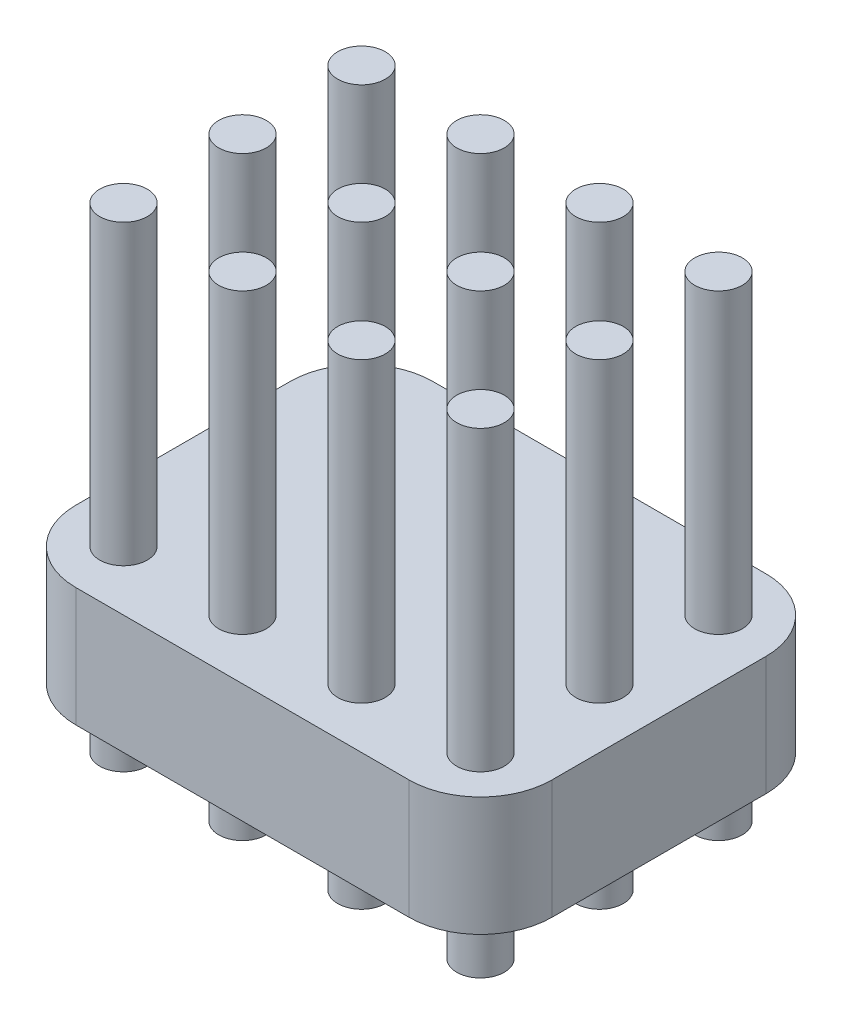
ISO-10303-21;
HEADER;
FILE_DESCRIPTION(('STEP AP214'),'2;1');
FILE_NAME('part.step','',(''),(''),'','','');
FILE_SCHEMA(('AUTOMOTIVE_DESIGN { 1 0 10303 214 1 1 1 1 }'));
ENDSEC;
DATA;
#1=APPLICATION_CONTEXT('core data for automotive mechanical design processes');
#2=APPLICATION_PROTOCOL_DEFINITION('international standard','automotive_design',2000,#1);
#3=PRODUCT_CONTEXT('',#1,'mechanical');
#4=PRODUCT('Part','Part','',(#3));
#5=PRODUCT_RELATED_PRODUCT_CATEGORY('part','',(#4));
#6=PRODUCT_DEFINITION_FORMATION('','',#4);
#7=PRODUCT_DEFINITION_CONTEXT('part definition',#1,'design');
#8=PRODUCT_DEFINITION('design','',#6,#7);
#9=PRODUCT_DEFINITION_SHAPE('','',#8);
#10=(LENGTH_UNIT() NAMED_UNIT(*) SI_UNIT(.MILLI.,.METRE.));
#11=(NAMED_UNIT(*) PLANE_ANGLE_UNIT() SI_UNIT($,.RADIAN.));
#12=(NAMED_UNIT(*) SI_UNIT($,.STERADIAN.) SOLID_ANGLE_UNIT());
#13=UNCERTAINTY_MEASURE_WITH_UNIT(LENGTH_MEASURE(1.E-05),#10,'distance_accuracy_value','');
#14=(GEOMETRIC_REPRESENTATION_CONTEXT(3) GLOBAL_UNCERTAINTY_ASSIGNED_CONTEXT((#13)) GLOBAL_UNIT_ASSIGNED_CONTEXT((#10,
#11,#12)) REPRESENTATION_CONTEXT('',''));
#15=CARTESIAN_POINT('',(0.,0.,0.));
#16=DIRECTION('',(0.,0.,1.));
#17=DIRECTION('',(1.,0.,0.));
#18=AXIS2_PLACEMENT_3D('',#15,#16,#17);
#19=CARTESIAN_POINT('',(-7.5,-5.,-4.99999999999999));
#20=DIRECTION('',(0.,1.,0.));
#21=DIRECTION('',(0.,0.,1.));
#22=AXIS2_PLACEMENT_3D('',#19,#20,#21);
#23=CYLINDRICAL_SURFACE('',#22,1.);
#24=CARTESIAN_POINT('',(-7.5,-5.,-4.99999999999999));
#25=DIRECTION('',(0.,1.,0.));
#26=DIRECTION('',(0.,0.,1.));
#27=AXIS2_PLACEMENT_3D('',#24,#25,#26);
#28=CIRCLE('',#27,1.);
#29=CARTESIAN_POINT('',(-7.5,-5.,-3.99999999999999));
#30=VERTEX_POINT('',#29);
#31=EDGE_CURVE('E11',#30,#30,#28,.T.);
#32=ORIENTED_EDGE('',*,*,#31,.T.);
#33=EDGE_LOOP('',(#32));
#34=FACE_BOUND('',#33,.T.);
#35=CARTESIAN_POINT('',(-7.5,15.,-4.99999999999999));
#36=DIRECTION('',(0.,1.,0.));
#37=DIRECTION('',(0.,0.,1.));
#38=AXIS2_PLACEMENT_3D('',#35,#36,#37);
#39=CIRCLE('',#38,1.);
#40=CARTESIAN_POINT('',(-7.5,15.,-3.99999999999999));
#41=VERTEX_POINT('',#40);
#42=EDGE_CURVE('E51',#41,#41,#39,.T.);
#43=ORIENTED_EDGE('',*,*,#42,.F.);
#44=EDGE_LOOP('',(#43));
#45=FACE_BOUND('',#44,.T.);
#46=ADVANCED_FACE('F45',(#34,#45),#23,.T.);
#47=CARTESIAN_POINT('',(-7.5,-5.,-4.99999999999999));
#48=DIRECTION('',(0.,1.,0.));
#49=DIRECTION('',(0.,0.,1.));
#50=AXIS2_PLACEMENT_3D('',#47,#48,#49);
#51=PLANE('',#50);
#52=ORIENTED_EDGE('',*,*,#31,.F.);
#53=EDGE_LOOP('',(#52));
#54=FACE_BOUND('',#53,.T.);
#55=ADVANCED_FACE('F60',(#54),#51,.F.);
#56=CARTESIAN_POINT('',(-7.5,15.,-4.99999999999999));
#57=DIRECTION('',(0.,1.,0.));
#58=DIRECTION('',(0.,0.,1.));
#59=AXIS2_PLACEMENT_3D('',#56,#57,#58);
#60=PLANE('',#59);
#61=ORIENTED_EDGE('',*,*,#42,.T.);
#62=EDGE_LOOP('',(#61));
#63=FACE_BOUND('',#62,.T.);
#64=ADVANCED_FACE('F57',(#63),#60,.T.);
#65=CLOSED_SHELL('',(#46,#55,#64));
#66=MANIFOLD_SOLID_BREP('B2',#65);
#67=CARTESIAN_POINT('',(-10.,2.5,-7.49999999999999));
#68=DIRECTION('',(1.,0.,0.));
#69=DIRECTION('',(0.,0.,-1.));
#70=AXIS2_PLACEMENT_3D('',#67,#68,#69);
#71=PLANE('',#70);
#72=DIRECTION('',(0.,0.,1.));
#73=VECTOR('',#72,1.);
#74=CARTESIAN_POINT('',(-10.,-2.5,-7.49999999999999));
#75=LINE('',#74,#73);
#76=CARTESIAN_POINT('',(-10.,-2.5,-4.49999999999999));
#77=VERTEX_POINT('',#76);
#78=CARTESIAN_POINT('',(-10.,-2.5,4.50000000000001));
#79=VERTEX_POINT('',#78);
#80=EDGE_CURVE('E182',#77,#79,#75,.T.);
#81=ORIENTED_EDGE('',*,*,#80,.T.);
#82=DIRECTION('',(0.,-1.,0.));
#83=VECTOR('',#82,1.);
#84=CARTESIAN_POINT('',(-10.,2.5,4.50000000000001));
#85=LINE('',#84,#83);
#86=CARTESIAN_POINT('',(-10.,2.5,4.50000000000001));
#87=VERTEX_POINT('',#86);
#88=EDGE_CURVE('E43',#79,#87,#85,.F.);
#89=ORIENTED_EDGE('',*,*,#88,.T.);
#90=DIRECTION('',(0.,0.,1.));
#91=VECTOR('',#90,1.);
#92=CARTESIAN_POINT('',(-10.,2.5,-7.49999999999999));
#93=LINE('',#92,#91);
#94=CARTESIAN_POINT('',(-10.,2.5,-4.49999999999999));
#95=VERTEX_POINT('',#94);
#96=EDGE_CURVE('E180',#95,#87,#93,.T.);
#97=ORIENTED_EDGE('',*,*,#96,.F.);
#98=DIRECTION('',(0.,-1.,0.));
#99=VECTOR('',#98,1.);
#100=CARTESIAN_POINT('',(-10.,2.5,-4.49999999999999));
#101=LINE('',#100,#99);
#102=EDGE_CURVE('E94',#95,#77,#101,.T.);
#103=ORIENTED_EDGE('',*,*,#102,.T.);
#104=EDGE_LOOP('',(#81,#89,#97,#103));
#105=FACE_BOUND('',#104,.T.);
#106=ADVANCED_FACE('F86',(#105),#71,.F.);
#107=CARTESIAN_POINT('',(10.,2.5,7.50000000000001));
#108=DIRECTION('',(0.,0.,-1.));
#109=DIRECTION('',(-1.,0.,0.));
#110=AXIS2_PLACEMENT_3D('',#107,#108,#109);
#111=PLANE('',#110);
#112=DIRECTION('',(1.,0.,0.));
#113=VECTOR('',#112,1.);
#114=CARTESIAN_POINT('',(10.,-2.5,7.50000000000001));
#115=LINE('',#114,#113);
#116=CARTESIAN_POINT('',(-7.,-2.5,7.50000000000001));
#117=VERTEX_POINT('',#116);
#118=CARTESIAN_POINT('',(7.,-2.5,7.50000000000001));
#119=VERTEX_POINT('',#118);
#120=EDGE_CURVE('E178',#117,#119,#115,.T.);
#121=ORIENTED_EDGE('',*,*,#120,.T.);
#122=DIRECTION('',(0.,-1.,0.));
#123=VECTOR('',#122,1.);
#124=CARTESIAN_POINT('',(7.,2.5,7.50000000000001));
#125=LINE('',#124,#123);
#126=CARTESIAN_POINT('',(7.,2.5,7.50000000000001));
#127=VERTEX_POINT('',#126);
#128=EDGE_CURVE('E157',#119,#127,#125,.F.);
#129=ORIENTED_EDGE('',*,*,#128,.T.);
#130=DIRECTION('',(1.,0.,0.));
#131=VECTOR('',#130,1.);
#132=CARTESIAN_POINT('',(10.,2.5,7.50000000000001));
#133=LINE('',#132,#131);
#134=CARTESIAN_POINT('',(-7.,2.5,7.50000000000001));
#135=VERTEX_POINT('',#134);
#136=EDGE_CURVE('E255',#135,#127,#133,.T.);
#137=ORIENTED_EDGE('',*,*,#136,.F.);
#138=DIRECTION('',(0.,-1.,0.));
#139=VECTOR('',#138,1.);
#140=CARTESIAN_POINT('',(-7.,2.5,7.50000000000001));
#141=LINE('',#140,#139);
#142=EDGE_CURVE('E162',#135,#117,#141,.T.);
#143=ORIENTED_EDGE('',*,*,#142,.T.);
#144=EDGE_LOOP('',(#121,#129,#137,#143));
#145=FACE_BOUND('',#144,.T.);
#146=ADVANCED_FACE('F392',(#145),#111,.F.);
#147=CARTESIAN_POINT('',(10.,2.5,-7.49999999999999));
#148=DIRECTION('',(-1.,0.,0.));
#149=DIRECTION('',(0.,0.,1.));
#150=AXIS2_PLACEMENT_3D('',#147,#148,#149);
#151=PLANE('',#150);
#152=DIRECTION('',(0.,0.,-1.));
#153=VECTOR('',#152,1.);
#154=CARTESIAN_POINT('',(10.,2.5,-7.49999999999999));
#155=LINE('',#154,#153);
#156=CARTESIAN_POINT('',(10.,2.5,4.5));
#157=VERTEX_POINT('',#156);
#158=CARTESIAN_POINT('',(10.,2.5,-4.5));
#159=VERTEX_POINT('',#158);
#160=EDGE_CURVE('E171',#157,#159,#155,.T.);
#161=ORIENTED_EDGE('',*,*,#160,.F.);
#162=DIRECTION('',(0.,-1.,0.));
#163=VECTOR('',#162,1.);
#164=CARTESIAN_POINT('',(10.,2.5,4.5));
#165=LINE('',#164,#163);
#166=CARTESIAN_POINT('',(10.,-2.5,4.5));
#167=VERTEX_POINT('',#166);
#168=EDGE_CURVE('E156',#157,#167,#165,.T.);
#169=ORIENTED_EDGE('',*,*,#168,.T.);
#170=DIRECTION('',(0.,0.,-1.));
#171=VECTOR('',#170,1.);
#172=CARTESIAN_POINT('',(10.,-2.5,-7.49999999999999));
#173=LINE('',#172,#171);
#174=CARTESIAN_POINT('',(10.,-2.5,-4.5));
#175=VERTEX_POINT('',#174);
#176=EDGE_CURVE('E169',#167,#175,#173,.T.);
#177=ORIENTED_EDGE('',*,*,#176,.T.);
#178=DIRECTION('',(0.,-1.,0.));
#179=VECTOR('',#178,1.);
#180=CARTESIAN_POINT('',(10.,2.5,-4.5));
#181=LINE('',#180,#179);
#182=EDGE_CURVE('E173',#175,#159,#181,.F.);
#183=ORIENTED_EDGE('',*,*,#182,.T.);
#184=EDGE_LOOP('',(#161,#169,#177,#183));
#185=FACE_BOUND('',#184,.T.);
#186=ADVANCED_FACE('F168',(#185),#151,.F.);
#187=CARTESIAN_POINT('',(10.,2.5,-7.49999999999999));
#188=DIRECTION('',(0.,0.,1.));
#189=DIRECTION('',(1.,0.,0.));
#190=AXIS2_PLACEMENT_3D('',#187,#188,#189);
#191=PLANE('',#190);
#192=DIRECTION('',(-1.,0.,0.));
#193=VECTOR('',#192,1.);
#194=CARTESIAN_POINT('',(10.,2.5,-7.49999999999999));
#195=LINE('',#194,#193);
#196=CARTESIAN_POINT('',(7.,2.5,-7.49999999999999));
#197=VERTEX_POINT('',#196);
#198=CARTESIAN_POINT('',(-7.,2.5,-7.49999999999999));
#199=VERTEX_POINT('',#198);
#200=EDGE_CURVE('E190',#197,#199,#195,.T.);
#201=ORIENTED_EDGE('',*,*,#200,.F.);
#202=DIRECTION('',(0.,-1.,0.));
#203=VECTOR('',#202,1.);
#204=CARTESIAN_POINT('',(7.,2.5,-7.49999999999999));
#205=LINE('',#204,#203);
#206=CARTESIAN_POINT('',(7.,-2.5,-7.49999999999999));
#207=VERTEX_POINT('',#206);
#208=EDGE_CURVE('E236',#197,#207,#205,.T.);
#209=ORIENTED_EDGE('',*,*,#208,.T.);
#210=DIRECTION('',(-1.,0.,0.));
#211=VECTOR('',#210,1.);
#212=CARTESIAN_POINT('',(10.,-2.5,-7.49999999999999));
#213=LINE('',#212,#211);
#214=CARTESIAN_POINT('',(-7.,-2.5,-7.49999999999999));
#215=VERTEX_POINT('',#214);
#216=EDGE_CURVE('E177',#207,#215,#213,.T.);
#217=ORIENTED_EDGE('',*,*,#216,.T.);
#218=DIRECTION('',(0.,-1.,0.));
#219=VECTOR('',#218,1.);
#220=CARTESIAN_POINT('',(-7.,2.5,-7.49999999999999));
#221=LINE('',#220,#219);
#222=EDGE_CURVE('E101',#215,#199,#221,.F.);
#223=ORIENTED_EDGE('',*,*,#222,.T.);
#224=EDGE_LOOP('',(#201,#209,#217,#223));
#225=FACE_BOUND('',#224,.T.);
#226=ADVANCED_FACE('F367',(#225),#191,.F.);
#227=CARTESIAN_POINT('',(-10.,2.5,7.50000000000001));
#228=DIRECTION('',(0.,-1.,0.));
#229=DIRECTION('',(0.,0.,-1.));
#230=AXIS2_PLACEMENT_3D('',#227,#228,#229);
#231=PLANE('',#230);
#232=CARTESIAN_POINT('',(7.5,2.5,5.));
#233=DIRECTION('',(0.,-1.,0.));
#234=DIRECTION('',(0.,0.,-1.));
#235=AXIS2_PLACEMENT_3D('',#232,#233,#234);
#236=CIRCLE('',#235,1.);
#237=CARTESIAN_POINT('',(7.5,2.5,4.));
#238=VERTEX_POINT('',#237);
#239=EDGE_CURVE('E345',#238,#238,#236,.T.);
#240=ORIENTED_EDGE('',*,*,#239,.T.);
#241=EDGE_LOOP('',(#240));
#242=FACE_BOUND('',#241,.T.);
#243=CARTESIAN_POINT('',(7.5,2.5,0.));
#244=DIRECTION('',(0.,-1.,0.));
#245=DIRECTION('',(0.,0.,-1.));
#246=AXIS2_PLACEMENT_3D('',#243,#244,#245);
#247=CIRCLE('',#246,1.);
#248=CARTESIAN_POINT('',(7.5,2.5,-0.999999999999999));
#249=VERTEX_POINT('',#248);
#250=EDGE_CURVE('E336',#249,#249,#247,.T.);
#251=ORIENTED_EDGE('',*,*,#250,.T.);
#252=EDGE_LOOP('',(#251));
#253=FACE_BOUND('',#252,.T.);
#254=CARTESIAN_POINT('',(7.5,2.5,-5.));
#255=DIRECTION('',(0.,-1.,0.));
#256=DIRECTION('',(0.,0.,-1.));
#257=AXIS2_PLACEMENT_3D('',#254,#255,#256);
#258=CIRCLE('',#257,1.);
#259=CARTESIAN_POINT('',(7.5,2.5,-6.));
#260=VERTEX_POINT('',#259);
#261=EDGE_CURVE('E327',#260,#260,#258,.T.);
#262=ORIENTED_EDGE('',*,*,#261,.T.);
#263=EDGE_LOOP('',(#262));
#264=FACE_BOUND('',#263,.T.);
#265=CARTESIAN_POINT('',(2.5,2.5,5.));
#266=DIRECTION('',(0.,-1.,0.));
#267=DIRECTION('',(0.,0.,-1.));
#268=AXIS2_PLACEMENT_3D('',#265,#266,#267);
#269=CIRCLE('',#268,1.);
#270=CARTESIAN_POINT('',(2.5,2.5,4.));
#271=VERTEX_POINT('',#270);
#272=EDGE_CURVE('E318',#271,#271,#269,.T.);
#273=ORIENTED_EDGE('',*,*,#272,.T.);
#274=EDGE_LOOP('',(#273));
#275=FACE_BOUND('',#274,.T.);
#276=CARTESIAN_POINT('',(2.5,2.5,0.));
#277=DIRECTION('',(0.,-1.,0.));
#278=DIRECTION('',(0.,0.,-1.));
#279=AXIS2_PLACEMENT_3D('',#276,#277,#278);
#280=CIRCLE('',#279,1.);
#281=CARTESIAN_POINT('',(2.5,2.5,-0.999999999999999));
#282=VERTEX_POINT('',#281);
#283=EDGE_CURVE('E309',#282,#282,#280,.T.);
#284=ORIENTED_EDGE('',*,*,#283,.T.);
#285=EDGE_LOOP('',(#284));
#286=FACE_BOUND('',#285,.T.);
#287=CARTESIAN_POINT('',(2.5,2.5,-5.));
#288=DIRECTION('',(0.,-1.,0.));
#289=DIRECTION('',(0.,0.,-1.));
#290=AXIS2_PLACEMENT_3D('',#287,#288,#289);
#291=CIRCLE('',#290,1.);
#292=CARTESIAN_POINT('',(2.5,2.5,-6.));
#293=VERTEX_POINT('',#292);
#294=EDGE_CURVE('E300',#293,#293,#291,.T.);
#295=ORIENTED_EDGE('',*,*,#294,.T.);
#296=EDGE_LOOP('',(#295));
#297=FACE_BOUND('',#296,.T.);
#298=CARTESIAN_POINT('',(-2.5,2.5,5.00000000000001));
#299=DIRECTION('',(0.,-1.,0.));
#300=DIRECTION('',(0.,0.,-1.));
#301=AXIS2_PLACEMENT_3D('',#298,#299,#300);
#302=CIRCLE('',#301,1.);
#303=CARTESIAN_POINT('',(-2.5,2.5,4.));
#304=VERTEX_POINT('',#303);
#305=EDGE_CURVE('E291',#304,#304,#302,.T.);
#306=ORIENTED_EDGE('',*,*,#305,.T.);
#307=EDGE_LOOP('',(#306));
#308=FACE_BOUND('',#307,.T.);
#309=CARTESIAN_POINT('',(-2.5,2.5,0.));
#310=DIRECTION('',(0.,-1.,0.));
#311=DIRECTION('',(0.,0.,-1.));
#312=AXIS2_PLACEMENT_3D('',#309,#310,#311);
#313=CIRCLE('',#312,1.);
#314=CARTESIAN_POINT('',(-2.5,2.5,-0.999999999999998));
#315=VERTEX_POINT('',#314);
#316=EDGE_CURVE('E282',#315,#315,#313,.T.);
#317=ORIENTED_EDGE('',*,*,#316,.T.);
#318=EDGE_LOOP('',(#317));
#319=FACE_BOUND('',#318,.T.);
#320=CARTESIAN_POINT('',(-2.5,2.5,-4.99999999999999));
#321=DIRECTION('',(0.,-1.,0.));
#322=DIRECTION('',(0.,0.,-1.));
#323=AXIS2_PLACEMENT_3D('',#320,#321,#322);
#324=CIRCLE('',#323,1.);
#325=CARTESIAN_POINT('',(-2.5,2.5,-6.));
#326=VERTEX_POINT('',#325);
#327=EDGE_CURVE('E273',#326,#326,#324,.T.);
#328=ORIENTED_EDGE('',*,*,#327,.T.);
#329=EDGE_LOOP('',(#328));
#330=FACE_BOUND('',#329,.T.);
#331=CARTESIAN_POINT('',(-7.5,2.5,5.00000000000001));
#332=DIRECTION('',(0.,-1.,0.));
#333=DIRECTION('',(0.,0.,-1.));
#334=AXIS2_PLACEMENT_3D('',#331,#332,#333);
#335=CIRCLE('',#334,1.);
#336=CARTESIAN_POINT('',(-7.5,2.5,4.));
#337=VERTEX_POINT('',#336);
#338=EDGE_CURVE('E264',#337,#337,#335,.T.);
#339=ORIENTED_EDGE('',*,*,#338,.T.);
#340=EDGE_LOOP('',(#339));
#341=FACE_BOUND('',#340,.T.);
#342=CARTESIAN_POINT('',(-7.5,2.5,0.));
#343=DIRECTION('',(0.,-1.,0.));
#344=DIRECTION('',(0.,0.,-1.));
#345=AXIS2_PLACEMENT_3D('',#342,#343,#344);
#346=CIRCLE('',#345,1.);
#347=CARTESIAN_POINT('',(-7.5,2.5,-0.999999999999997));
#348=VERTEX_POINT('',#347);
#349=EDGE_CURVE('E248',#348,#348,#346,.T.);
#350=ORIENTED_EDGE('',*,*,#349,.T.);
#351=EDGE_LOOP('',(#350));
#352=FACE_BOUND('',#351,.T.);
#353=ORIENTED_EDGE('',*,*,#136,.T.);
#354=CARTESIAN_POINT('',(7.,2.5,4.5));
#355=DIRECTION('',(0.,-1.,0.));
#356=DIRECTION('',(0.,0.,-1.));
#357=AXIS2_PLACEMENT_3D('',#354,#355,#356);
#358=CIRCLE('',#357,3.);
#359=EDGE_CURVE('E233',#127,#157,#358,.F.);
#360=ORIENTED_EDGE('',*,*,#359,.T.);
#361=ORIENTED_EDGE('',*,*,#160,.T.);
#362=CARTESIAN_POINT('',(7.,2.5,-4.49999999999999));
#363=DIRECTION('',(0.,-1.,0.));
#364=DIRECTION('',(0.,0.,-1.));
#365=AXIS2_PLACEMENT_3D('',#362,#363,#364);
#366=CIRCLE('',#365,3.);
#367=EDGE_CURVE('E108',#159,#197,#366,.F.);
#368=ORIENTED_EDGE('',*,*,#367,.T.);
#369=ORIENTED_EDGE('',*,*,#200,.T.);
#370=CARTESIAN_POINT('',(-7.,2.5,-4.49999999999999));
#371=DIRECTION('',(0.,-1.,0.));
#372=DIRECTION('',(0.,0.,-1.));
#373=AXIS2_PLACEMENT_3D('',#370,#371,#372);
#374=CIRCLE('',#373,3.);
#375=EDGE_CURVE('E228',#199,#95,#374,.F.);
#376=ORIENTED_EDGE('',*,*,#375,.T.);
#377=ORIENTED_EDGE('',*,*,#96,.T.);
#378=CARTESIAN_POINT('',(-7.,2.5,4.50000000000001));
#379=DIRECTION('',(0.,-1.,0.));
#380=DIRECTION('',(0.,0.,-1.));
#381=AXIS2_PLACEMENT_3D('',#378,#379,#380);
#382=CIRCLE('',#381,3.);
#383=EDGE_CURVE('E230',#87,#135,#382,.F.);
#384=ORIENTED_EDGE('',*,*,#383,.T.);
#385=EDGE_LOOP('',(#353,#360,#361,#368,#369,#376,#377,#384));
#386=FACE_BOUND('',#385,.T.);
#387=ADVANCED_FACE('F364',(#242,#253,#264,#275,#286,#297,#308,#319,#330,#341,#352,#386),#231,.F.);
#388=CARTESIAN_POINT('',(-10.,-2.5,7.50000000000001));
#389=DIRECTION('',(0.,-1.,0.));
#390=DIRECTION('',(0.,0.,-1.));
#391=AXIS2_PLACEMENT_3D('',#388,#389,#390);
#392=PLANE('',#391);
#393=CARTESIAN_POINT('',(7.5,-2.5,5.));
#394=DIRECTION('',(0.,-1.,0.));
#395=DIRECTION('',(0.,0.,-1.));
#396=AXIS2_PLACEMENT_3D('',#393,#394,#395);
#397=CIRCLE('',#396,1.);
#398=CARTESIAN_POINT('',(7.5,-2.5,4.));
#399=VERTEX_POINT('',#398);
#400=EDGE_CURVE('E217',#399,#399,#397,.T.);
#401=ORIENTED_EDGE('',*,*,#400,.F.);
#402=EDGE_LOOP('',(#401));
#403=FACE_BOUND('',#402,.T.);
#404=CARTESIAN_POINT('',(7.5,-2.5,0.));
#405=DIRECTION('',(0.,-1.,0.));
#406=DIRECTION('',(0.,0.,-1.));
#407=AXIS2_PLACEMENT_3D('',#404,#405,#406);
#408=CIRCLE('',#407,1.);
#409=CARTESIAN_POINT('',(7.5,-2.5,-0.999999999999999));
#410=VERTEX_POINT('',#409);
#411=EDGE_CURVE('E214',#410,#410,#408,.T.);
#412=ORIENTED_EDGE('',*,*,#411,.F.);
#413=EDGE_LOOP('',(#412));
#414=FACE_BOUND('',#413,.T.);
#415=CARTESIAN_POINT('',(7.5,-2.5,-5.));
#416=DIRECTION('',(0.,-1.,0.));
#417=DIRECTION('',(0.,0.,-1.));
#418=AXIS2_PLACEMENT_3D('',#415,#416,#417);
#419=CIRCLE('',#418,1.);
#420=CARTESIAN_POINT('',(7.5,-2.5,-6.));
#421=VERTEX_POINT('',#420);
#422=EDGE_CURVE('E211',#421,#421,#419,.T.);
#423=ORIENTED_EDGE('',*,*,#422,.F.);
#424=EDGE_LOOP('',(#423));
#425=FACE_BOUND('',#424,.T.);
#426=CARTESIAN_POINT('',(2.5,-2.5,5.));
#427=DIRECTION('',(0.,-1.,0.));
#428=DIRECTION('',(0.,0.,-1.));
#429=AXIS2_PLACEMENT_3D('',#426,#427,#428);
#430=CIRCLE('',#429,1.);
#431=CARTESIAN_POINT('',(2.5,-2.5,4.));
#432=VERTEX_POINT('',#431);
#433=EDGE_CURVE('E208',#432,#432,#430,.T.);
#434=ORIENTED_EDGE('',*,*,#433,.F.);
#435=EDGE_LOOP('',(#434));
#436=FACE_BOUND('',#435,.T.);
#437=CARTESIAN_POINT('',(2.5,-2.5,0.));
#438=DIRECTION('',(0.,-1.,0.));
#439=DIRECTION('',(0.,0.,-1.));
#440=AXIS2_PLACEMENT_3D('',#437,#438,#439);
#441=CIRCLE('',#440,1.);
#442=CARTESIAN_POINT('',(2.5,-2.5,-0.999999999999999));
#443=VERTEX_POINT('',#442);
#444=EDGE_CURVE('E205',#443,#443,#441,.T.);
#445=ORIENTED_EDGE('',*,*,#444,.F.);
#446=EDGE_LOOP('',(#445));
#447=FACE_BOUND('',#446,.T.);
#448=CARTESIAN_POINT('',(2.5,-2.5,-5.));
#449=DIRECTION('',(0.,-1.,0.));
#450=DIRECTION('',(0.,0.,-1.));
#451=AXIS2_PLACEMENT_3D('',#448,#449,#450);
#452=CIRCLE('',#451,1.);
#453=CARTESIAN_POINT('',(2.5,-2.5,-6.));
#454=VERTEX_POINT('',#453);
#455=EDGE_CURVE('E202',#454,#454,#452,.T.);
#456=ORIENTED_EDGE('',*,*,#455,.F.);
#457=EDGE_LOOP('',(#456));
#458=FACE_BOUND('',#457,.T.);
#459=CARTESIAN_POINT('',(-2.5,-2.5,5.00000000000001));
#460=DIRECTION('',(0.,-1.,0.));
#461=DIRECTION('',(0.,0.,-1.));
#462=AXIS2_PLACEMENT_3D('',#459,#460,#461);
#463=CIRCLE('',#462,1.);
#464=CARTESIAN_POINT('',(-2.5,-2.5,4.));
#465=VERTEX_POINT('',#464);
#466=EDGE_CURVE('E199',#465,#465,#463,.T.);
#467=ORIENTED_EDGE('',*,*,#466,.F.);
#468=EDGE_LOOP('',(#467));
#469=FACE_BOUND('',#468,.T.);
#470=CARTESIAN_POINT('',(-2.5,-2.5,0.));
#471=DIRECTION('',(0.,-1.,0.));
#472=DIRECTION('',(0.,0.,-1.));
#473=AXIS2_PLACEMENT_3D('',#470,#471,#472);
#474=CIRCLE('',#473,1.);
#475=CARTESIAN_POINT('',(-2.5,-2.5,-0.999999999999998));
#476=VERTEX_POINT('',#475);
#477=EDGE_CURVE('E196',#476,#476,#474,.T.);
#478=ORIENTED_EDGE('',*,*,#477,.F.);
#479=EDGE_LOOP('',(#478));
#480=FACE_BOUND('',#479,.T.);
#481=CARTESIAN_POINT('',(-2.5,-2.5,-4.99999999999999));
#482=DIRECTION('',(0.,-1.,0.));
#483=DIRECTION('',(0.,0.,-1.));
#484=AXIS2_PLACEMENT_3D('',#481,#482,#483);
#485=CIRCLE('',#484,1.);
#486=CARTESIAN_POINT('',(-2.5,-2.5,-6.));
#487=VERTEX_POINT('',#486);
#488=EDGE_CURVE('E193',#487,#487,#485,.T.);
#489=ORIENTED_EDGE('',*,*,#488,.F.);
#490=EDGE_LOOP('',(#489));
#491=FACE_BOUND('',#490,.T.);
#492=CARTESIAN_POINT('',(-7.5,-2.5,5.00000000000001));
#493=DIRECTION('',(0.,-1.,0.));
#494=DIRECTION('',(0.,0.,-1.));
#495=AXIS2_PLACEMENT_3D('',#492,#493,#494);
#496=CIRCLE('',#495,1.);
#497=CARTESIAN_POINT('',(-7.5,-2.5,4.));
#498=VERTEX_POINT('',#497);
#499=EDGE_CURVE('E189',#498,#498,#496,.T.);
#500=ORIENTED_EDGE('',*,*,#499,.F.);
#501=EDGE_LOOP('',(#500));
#502=FACE_BOUND('',#501,.T.);
#503=CARTESIAN_POINT('',(-7.5,-2.5,0.));
#504=DIRECTION('',(0.,-1.,0.));
#505=DIRECTION('',(0.,0.,-1.));
#506=AXIS2_PLACEMENT_3D('',#503,#504,#505);
#507=CIRCLE('',#506,1.);
#508=CARTESIAN_POINT('',(-7.5,-2.5,-0.999999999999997));
#509=VERTEX_POINT('',#508);
#510=EDGE_CURVE('E186',#509,#509,#507,.T.);
#511=ORIENTED_EDGE('',*,*,#510,.F.);
#512=EDGE_LOOP('',(#511));
#513=FACE_BOUND('',#512,.T.);
#514=ORIENTED_EDGE('',*,*,#176,.F.);
#515=CARTESIAN_POINT('',(7.,-2.5,4.5));
#516=DIRECTION('',(0.,-1.,0.));
#517=DIRECTION('',(0.,0.,-1.));
#518=AXIS2_PLACEMENT_3D('',#515,#516,#517);
#519=CIRCLE('',#518,3.);
#520=EDGE_CURVE('E152',#167,#119,#519,.T.);
#521=ORIENTED_EDGE('',*,*,#520,.T.);
#522=ORIENTED_EDGE('',*,*,#120,.F.);
#523=CARTESIAN_POINT('',(-7.,-2.5,4.50000000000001));
#524=DIRECTION('',(0.,-1.,0.));
#525=DIRECTION('',(0.,0.,-1.));
#526=AXIS2_PLACEMENT_3D('',#523,#524,#525);
#527=CIRCLE('',#526,3.);
#528=EDGE_CURVE('E222',#117,#79,#527,.T.);
#529=ORIENTED_EDGE('',*,*,#528,.T.);
#530=ORIENTED_EDGE('',*,*,#80,.F.);
#531=CARTESIAN_POINT('',(-7.,-2.5,-4.49999999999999));
#532=DIRECTION('',(0.,-1.,0.));
#533=DIRECTION('',(0.,0.,-1.));
#534=AXIS2_PLACEMENT_3D('',#531,#532,#533);
#535=CIRCLE('',#534,3.);
#536=EDGE_CURVE('E172',#77,#215,#535,.T.);
#537=ORIENTED_EDGE('',*,*,#536,.T.);
#538=ORIENTED_EDGE('',*,*,#216,.F.);
#539=CARTESIAN_POINT('',(7.,-2.5,-4.49999999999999));
#540=DIRECTION('',(0.,-1.,0.));
#541=DIRECTION('',(0.,0.,-1.));
#542=AXIS2_PLACEMENT_3D('',#539,#540,#541);
#543=CIRCLE('',#542,3.);
#544=EDGE_CURVE('E163',#207,#175,#543,.T.);
#545=ORIENTED_EDGE('',*,*,#544,.T.);
#546=EDGE_LOOP('',(#514,#521,#522,#529,#530,#537,#538,#545));
#547=FACE_BOUND('',#546,.T.);
#548=ADVANCED_FACE('F175',(#403,#414,#425,#436,#447,#458,#469,#480,#491,#502,#513,#547),#392,.T.);
#549=CARTESIAN_POINT('',(-7.5,-5.,0.));
#550=DIRECTION('',(0.,1.,0.));
#551=DIRECTION('',(0.,0.,1.));
#552=AXIS2_PLACEMENT_3D('',#549,#550,#551);
#553=PLANE('',#552);
#554=CARTESIAN_POINT('',(-7.5,-5.,0.));
#555=DIRECTION('',(0.,1.,0.));
#556=DIRECTION('',(0.,0.,1.));
#557=AXIS2_PLACEMENT_3D('',#554,#555,#556);
#558=CIRCLE('',#557,1.);
#559=CARTESIAN_POINT('',(-7.5,-5.,1.00000000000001));
#560=VERTEX_POINT('',#559);
#561=EDGE_CURVE('E250',#560,#560,#558,.T.);
#562=ORIENTED_EDGE('',*,*,#561,.F.);
#563=EDGE_LOOP('',(#562));
#564=FACE_BOUND('',#563,.T.);
#565=ADVANCED_FACE('F422',(#564),#553,.F.);
#566=CARTESIAN_POINT('',(-7.5,-5.,0.));
#567=DIRECTION('',(0.,1.,0.));
#568=DIRECTION('',(0.,0.,1.));
#569=AXIS2_PLACEMENT_3D('',#566,#567,#568);
#570=CYLINDRICAL_SURFACE('',#569,1.);
#571=ORIENTED_EDGE('',*,*,#510,.T.);
#572=EDGE_LOOP('',(#571));
#573=FACE_BOUND('',#572,.T.);
#574=ORIENTED_EDGE('',*,*,#561,.T.);
#575=EDGE_LOOP('',(#574));
#576=FACE_BOUND('',#575,.T.);
#577=ADVANCED_FACE('F425',(#573,#576),#570,.T.);
#578=CARTESIAN_POINT('',(-7.5,15.,0.));
#579=DIRECTION('',(0.,1.,0.));
#580=DIRECTION('',(0.,0.,1.));
#581=AXIS2_PLACEMENT_3D('',#578,#579,#580);
#582=CIRCLE('',#581,1.);
#583=CARTESIAN_POINT('',(-7.5,15.,1.00000000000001));
#584=VERTEX_POINT('',#583);
#585=EDGE_CURVE('E261',#584,#584,#582,.T.);
#586=ORIENTED_EDGE('',*,*,#585,.F.);
#587=EDGE_LOOP('',(#586));
#588=FACE_BOUND('',#587,.T.);
#589=ORIENTED_EDGE('',*,*,#349,.F.);
#590=EDGE_LOOP('',(#589));
#591=FACE_BOUND('',#590,.T.);
#592=ADVANCED_FACE('F428',(#588,#591),#570,.T.);
#593=CARTESIAN_POINT('',(-7.5,15.,0.));
#594=DIRECTION('',(0.,1.,0.));
#595=DIRECTION('',(0.,0.,1.));
#596=AXIS2_PLACEMENT_3D('',#593,#594,#595);
#597=PLANE('',#596);
#598=ORIENTED_EDGE('',*,*,#585,.T.);
#599=EDGE_LOOP('',(#598));
#600=FACE_BOUND('',#599,.T.);
#601=ADVANCED_FACE('F433',(#600),#597,.T.);
#602=CARTESIAN_POINT('',(-7.5,-5.,5.00000000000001));
#603=DIRECTION('',(0.,1.,0.));
#604=DIRECTION('',(0.,0.,1.));
#605=AXIS2_PLACEMENT_3D('',#602,#603,#604);
#606=PLANE('',#605);
#607=CARTESIAN_POINT('',(-7.5,-5.,5.00000000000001));
#608=DIRECTION('',(0.,1.,0.));
#609=DIRECTION('',(0.,0.,1.));
#610=AXIS2_PLACEMENT_3D('',#607,#608,#609);
#611=CIRCLE('',#610,1.);
#612=CARTESIAN_POINT('',(-7.5,-5.,6.00000000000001));
#613=VERTEX_POINT('',#612);
#614=EDGE_CURVE('E267',#613,#613,#611,.T.);
#615=ORIENTED_EDGE('',*,*,#614,.F.);
#616=EDGE_LOOP('',(#615));
#617=FACE_BOUND('',#616,.T.);
#618=ADVANCED_FACE('F436',(#617),#606,.F.);
#619=CARTESIAN_POINT('',(-7.5,-5.,5.00000000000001));
#620=DIRECTION('',(0.,1.,0.));
#621=DIRECTION('',(0.,0.,1.));
#622=AXIS2_PLACEMENT_3D('',#619,#620,#621);
#623=CYLINDRICAL_SURFACE('',#622,1.);
#624=ORIENTED_EDGE('',*,*,#499,.T.);
#625=EDGE_LOOP('',(#624));
#626=FACE_BOUND('',#625,.T.);
#627=ORIENTED_EDGE('',*,*,#614,.T.);
#628=EDGE_LOOP('',(#627));
#629=FACE_BOUND('',#628,.T.);
#630=ADVANCED_FACE('F438',(#626,#629),#623,.T.);
#631=CARTESIAN_POINT('',(-7.5,15.,5.00000000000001));
#632=DIRECTION('',(0.,1.,0.));
#633=DIRECTION('',(0.,0.,1.));
#634=AXIS2_PLACEMENT_3D('',#631,#632,#633);
#635=CIRCLE('',#634,1.);
#636=CARTESIAN_POINT('',(-7.5,15.,6.00000000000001));
#637=VERTEX_POINT('',#636);
#638=EDGE_CURVE('E270',#637,#637,#635,.T.);
#639=ORIENTED_EDGE('',*,*,#638,.F.);
#640=EDGE_LOOP('',(#639));
#641=FACE_BOUND('',#640,.T.);
#642=ORIENTED_EDGE('',*,*,#338,.F.);
#643=EDGE_LOOP('',(#642));
#644=FACE_BOUND('',#643,.T.);
#645=ADVANCED_FACE('F441',(#641,#644),#623,.T.);
#646=CARTESIAN_POINT('',(-7.5,15.,5.00000000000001));
#647=DIRECTION('',(0.,1.,0.));
#648=DIRECTION('',(0.,0.,1.));
#649=AXIS2_PLACEMENT_3D('',#646,#647,#648);
#650=PLANE('',#649);
#651=ORIENTED_EDGE('',*,*,#638,.T.);
#652=EDGE_LOOP('',(#651));
#653=FACE_BOUND('',#652,.T.);
#654=ADVANCED_FACE('F446',(#653),#650,.T.);
#655=CARTESIAN_POINT('',(-2.5,-5.,-4.99999999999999));
#656=DIRECTION('',(0.,1.,0.));
#657=DIRECTION('',(0.,0.,1.));
#658=AXIS2_PLACEMENT_3D('',#655,#656,#657);
#659=PLANE('',#658);
#660=CARTESIAN_POINT('',(-2.5,-5.,-4.99999999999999));
#661=DIRECTION('',(0.,1.,0.));
#662=DIRECTION('',(0.,0.,1.));
#663=AXIS2_PLACEMENT_3D('',#660,#661,#662);
#664=CIRCLE('',#663,1.);
#665=CARTESIAN_POINT('',(-2.5,-5.,-3.99999999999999));
#666=VERTEX_POINT('',#665);
#667=EDGE_CURVE('E276',#666,#666,#664,.T.);
#668=ORIENTED_EDGE('',*,*,#667,.F.);
#669=EDGE_LOOP('',(#668));
#670=FACE_BOUND('',#669,.T.);
#671=ADVANCED_FACE('F449',(#670),#659,.F.);
#672=CARTESIAN_POINT('',(-2.5,-5.,-4.99999999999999));
#673=DIRECTION('',(0.,1.,0.));
#674=DIRECTION('',(0.,0.,1.));
#675=AXIS2_PLACEMENT_3D('',#672,#673,#674);
#676=CYLINDRICAL_SURFACE('',#675,1.);
#677=ORIENTED_EDGE('',*,*,#488,.T.);
#678=EDGE_LOOP('',(#677));
#679=FACE_BOUND('',#678,.T.);
#680=ORIENTED_EDGE('',*,*,#667,.T.);
#681=EDGE_LOOP('',(#680));
#682=FACE_BOUND('',#681,.T.);
#683=ADVANCED_FACE('F451',(#679,#682),#676,.T.);
#684=CARTESIAN_POINT('',(-2.5,15.,-4.99999999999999));
#685=DIRECTION('',(0.,1.,0.));
#686=DIRECTION('',(0.,0.,1.));
#687=AXIS2_PLACEMENT_3D('',#684,#685,#686);
#688=CIRCLE('',#687,1.);
#689=CARTESIAN_POINT('',(-2.5,15.,-3.99999999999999));
#690=VERTEX_POINT('',#689);
#691=EDGE_CURVE('E279',#690,#690,#688,.T.);
#692=ORIENTED_EDGE('',*,*,#691,.F.);
#693=EDGE_LOOP('',(#692));
#694=FACE_BOUND('',#693,.T.);
#695=ORIENTED_EDGE('',*,*,#327,.F.);
#696=EDGE_LOOP('',(#695));
#697=FACE_BOUND('',#696,.T.);
#698=ADVANCED_FACE('F454',(#694,#697),#676,.T.);
#699=CARTESIAN_POINT('',(-2.5,15.,-4.99999999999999));
#700=DIRECTION('',(0.,1.,0.));
#701=DIRECTION('',(0.,0.,1.));
#702=AXIS2_PLACEMENT_3D('',#699,#700,#701);
#703=PLANE('',#702);
#704=ORIENTED_EDGE('',*,*,#691,.T.);
#705=EDGE_LOOP('',(#704));
#706=FACE_BOUND('',#705,.T.);
#707=ADVANCED_FACE('F459',(#706),#703,.T.);
#708=CARTESIAN_POINT('',(-2.5,-5.,0.));
#709=DIRECTION('',(0.,1.,0.));
#710=DIRECTION('',(0.,0.,1.));
#711=AXIS2_PLACEMENT_3D('',#708,#709,#710);
#712=PLANE('',#711);
#713=CARTESIAN_POINT('',(-2.5,-5.,0.));
#714=DIRECTION('',(0.,1.,0.));
#715=DIRECTION('',(0.,0.,1.));
#716=AXIS2_PLACEMENT_3D('',#713,#714,#715);
#717=CIRCLE('',#716,1.);
#718=CARTESIAN_POINT('',(-2.5,-5.,1.00000000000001));
#719=VERTEX_POINT('',#718);
#720=EDGE_CURVE('E285',#719,#719,#717,.T.);
#721=ORIENTED_EDGE('',*,*,#720,.F.);
#722=EDGE_LOOP('',(#721));
#723=FACE_BOUND('',#722,.T.);
#724=ADVANCED_FACE('F462',(#723),#712,.F.);
#725=CARTESIAN_POINT('',(-2.5,-5.,0.));
#726=DIRECTION('',(0.,1.,0.));
#727=DIRECTION('',(0.,0.,1.));
#728=AXIS2_PLACEMENT_3D('',#725,#726,#727);
#729=CYLINDRICAL_SURFACE('',#728,1.);
#730=ORIENTED_EDGE('',*,*,#477,.T.);
#731=EDGE_LOOP('',(#730));
#732=FACE_BOUND('',#731,.T.);
#733=ORIENTED_EDGE('',*,*,#720,.T.);
#734=EDGE_LOOP('',(#733));
#735=FACE_BOUND('',#734,.T.);
#736=ADVANCED_FACE('F464',(#732,#735),#729,.T.);
#737=CARTESIAN_POINT('',(-2.5,15.,0.));
#738=DIRECTION('',(0.,1.,0.));
#739=DIRECTION('',(0.,0.,1.));
#740=AXIS2_PLACEMENT_3D('',#737,#738,#739);
#741=CIRCLE('',#740,1.);
#742=CARTESIAN_POINT('',(-2.5,15.,1.00000000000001));
#743=VERTEX_POINT('',#742);
#744=EDGE_CURVE('E288',#743,#743,#741,.T.);
#745=ORIENTED_EDGE('',*,*,#744,.F.);
#746=EDGE_LOOP('',(#745));
#747=FACE_BOUND('',#746,.T.);
#748=ORIENTED_EDGE('',*,*,#316,.F.);
#749=EDGE_LOOP('',(#748));
#750=FACE_BOUND('',#749,.T.);
#751=ADVANCED_FACE('F467',(#747,#750),#729,.T.);
#752=CARTESIAN_POINT('',(-2.5,15.,0.));
#753=DIRECTION('',(0.,1.,0.));
#754=DIRECTION('',(0.,0.,1.));
#755=AXIS2_PLACEMENT_3D('',#752,#753,#754);
#756=PLANE('',#755);
#757=ORIENTED_EDGE('',*,*,#744,.T.);
#758=EDGE_LOOP('',(#757));
#759=FACE_BOUND('',#758,.T.);
#760=ADVANCED_FACE('F472',(#759),#756,.T.);
#761=CARTESIAN_POINT('',(-2.5,-5.,5.00000000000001));
#762=DIRECTION('',(0.,1.,0.));
#763=DIRECTION('',(0.,0.,1.));
#764=AXIS2_PLACEMENT_3D('',#761,#762,#763);
#765=PLANE('',#764);
#766=CARTESIAN_POINT('',(-2.5,-5.,5.00000000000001));
#767=DIRECTION('',(0.,1.,0.));
#768=DIRECTION('',(0.,0.,1.));
#769=AXIS2_PLACEMENT_3D('',#766,#767,#768);
#770=CIRCLE('',#769,1.);
#771=CARTESIAN_POINT('',(-2.5,-5.,6.00000000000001));
#772=VERTEX_POINT('',#771);
#773=EDGE_CURVE('E294',#772,#772,#770,.T.);
#774=ORIENTED_EDGE('',*,*,#773,.F.);
#775=EDGE_LOOP('',(#774));
#776=FACE_BOUND('',#775,.T.);
#777=ADVANCED_FACE('F475',(#776),#765,.F.);
#778=CARTESIAN_POINT('',(-2.5,-5.,5.00000000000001));
#779=DIRECTION('',(0.,1.,0.));
#780=DIRECTION('',(0.,0.,1.));
#781=AXIS2_PLACEMENT_3D('',#778,#779,#780);
#782=CYLINDRICAL_SURFACE('',#781,1.);
#783=ORIENTED_EDGE('',*,*,#466,.T.);
#784=EDGE_LOOP('',(#783));
#785=FACE_BOUND('',#784,.T.);
#786=ORIENTED_EDGE('',*,*,#773,.T.);
#787=EDGE_LOOP('',(#786));
#788=FACE_BOUND('',#787,.T.);
#789=ADVANCED_FACE('F477',(#785,#788),#782,.T.);
#790=CARTESIAN_POINT('',(-2.5,15.,5.00000000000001));
#791=DIRECTION('',(0.,1.,0.));
#792=DIRECTION('',(0.,0.,1.));
#793=AXIS2_PLACEMENT_3D('',#790,#791,#792);
#794=CIRCLE('',#793,1.);
#795=CARTESIAN_POINT('',(-2.5,15.,6.00000000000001));
#796=VERTEX_POINT('',#795);
#797=EDGE_CURVE('E297',#796,#796,#794,.T.);
#798=ORIENTED_EDGE('',*,*,#797,.F.);
#799=EDGE_LOOP('',(#798));
#800=FACE_BOUND('',#799,.T.);
#801=ORIENTED_EDGE('',*,*,#305,.F.);
#802=EDGE_LOOP('',(#801));
#803=FACE_BOUND('',#802,.T.);
#804=ADVANCED_FACE('F480',(#800,#803),#782,.T.);
#805=CARTESIAN_POINT('',(-2.5,15.,5.00000000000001));
#806=DIRECTION('',(0.,1.,0.));
#807=DIRECTION('',(0.,0.,1.));
#808=AXIS2_PLACEMENT_3D('',#805,#806,#807);
#809=PLANE('',#808);
#810=ORIENTED_EDGE('',*,*,#797,.T.);
#811=EDGE_LOOP('',(#810));
#812=FACE_BOUND('',#811,.T.);
#813=ADVANCED_FACE('F485',(#812),#809,.T.);
#814=CARTESIAN_POINT('',(2.5,-5.,-5.));
#815=DIRECTION('',(0.,1.,0.));
#816=DIRECTION('',(0.,0.,1.));
#817=AXIS2_PLACEMENT_3D('',#814,#815,#816);
#818=PLANE('',#817);
#819=CARTESIAN_POINT('',(2.5,-5.,-5.));
#820=DIRECTION('',(0.,1.,0.));
#821=DIRECTION('',(0.,0.,1.));
#822=AXIS2_PLACEMENT_3D('',#819,#820,#821);
#823=CIRCLE('',#822,1.);
#824=CARTESIAN_POINT('',(2.5,-5.,-3.99999999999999));
#825=VERTEX_POINT('',#824);
#826=EDGE_CURVE('E303',#825,#825,#823,.T.);
#827=ORIENTED_EDGE('',*,*,#826,.F.);
#828=EDGE_LOOP('',(#827));
#829=FACE_BOUND('',#828,.T.);
#830=ADVANCED_FACE('F488',(#829),#818,.F.);
#831=CARTESIAN_POINT('',(2.5,-5.,-5.));
#832=DIRECTION('',(0.,1.,0.));
#833=DIRECTION('',(0.,0.,1.));
#834=AXIS2_PLACEMENT_3D('',#831,#832,#833);
#835=CYLINDRICAL_SURFACE('',#834,1.);
#836=ORIENTED_EDGE('',*,*,#455,.T.);
#837=EDGE_LOOP('',(#836));
#838=FACE_BOUND('',#837,.T.);
#839=ORIENTED_EDGE('',*,*,#826,.T.);
#840=EDGE_LOOP('',(#839));
#841=FACE_BOUND('',#840,.T.);
#842=ADVANCED_FACE('F490',(#838,#841),#835,.T.);
#843=CARTESIAN_POINT('',(2.5,15.,-5.));
#844=DIRECTION('',(0.,1.,0.));
#845=DIRECTION('',(0.,0.,1.));
#846=AXIS2_PLACEMENT_3D('',#843,#844,#845);
#847=CIRCLE('',#846,1.);
#848=CARTESIAN_POINT('',(2.5,15.,-3.99999999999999));
#849=VERTEX_POINT('',#848);
#850=EDGE_CURVE('E306',#849,#849,#847,.T.);
#851=ORIENTED_EDGE('',*,*,#850,.F.);
#852=EDGE_LOOP('',(#851));
#853=FACE_BOUND('',#852,.T.);
#854=ORIENTED_EDGE('',*,*,#294,.F.);
#855=EDGE_LOOP('',(#854));
#856=FACE_BOUND('',#855,.T.);
#857=ADVANCED_FACE('F493',(#853,#856),#835,.T.);
#858=CARTESIAN_POINT('',(2.5,15.,-5.));
#859=DIRECTION('',(0.,1.,0.));
#860=DIRECTION('',(0.,0.,1.));
#861=AXIS2_PLACEMENT_3D('',#858,#859,#860);
#862=PLANE('',#861);
#863=ORIENTED_EDGE('',*,*,#850,.T.);
#864=EDGE_LOOP('',(#863));
#865=FACE_BOUND('',#864,.T.);
#866=ADVANCED_FACE('F498',(#865),#862,.T.);
#867=CARTESIAN_POINT('',(2.5,-5.,0.));
#868=DIRECTION('',(0.,1.,0.));
#869=DIRECTION('',(0.,0.,1.));
#870=AXIS2_PLACEMENT_3D('',#867,#868,#869);
#871=PLANE('',#870);
#872=CARTESIAN_POINT('',(2.5,-5.,0.));
#873=DIRECTION('',(0.,1.,0.));
#874=DIRECTION('',(0.,0.,1.));
#875=AXIS2_PLACEMENT_3D('',#872,#873,#874);
#876=CIRCLE('',#875,1.);
#877=CARTESIAN_POINT('',(2.5,-5.,1.00000000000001));
#878=VERTEX_POINT('',#877);
#879=EDGE_CURVE('E312',#878,#878,#876,.T.);
#880=ORIENTED_EDGE('',*,*,#879,.F.);
#881=EDGE_LOOP('',(#880));
#882=FACE_BOUND('',#881,.T.);
#883=ADVANCED_FACE('F501',(#882),#871,.F.);
#884=CARTESIAN_POINT('',(2.5,-5.,0.));
#885=DIRECTION('',(0.,1.,0.));
#886=DIRECTION('',(0.,0.,1.));
#887=AXIS2_PLACEMENT_3D('',#884,#885,#886);
#888=CYLINDRICAL_SURFACE('',#887,1.);
#889=ORIENTED_EDGE('',*,*,#444,.T.);
#890=EDGE_LOOP('',(#889));
#891=FACE_BOUND('',#890,.T.);
#892=ORIENTED_EDGE('',*,*,#879,.T.);
#893=EDGE_LOOP('',(#892));
#894=FACE_BOUND('',#893,.T.);
#895=ADVANCED_FACE('F503',(#891,#894),#888,.T.);
#896=CARTESIAN_POINT('',(2.5,15.,0.));
#897=DIRECTION('',(0.,1.,0.));
#898=DIRECTION('',(0.,0.,1.));
#899=AXIS2_PLACEMENT_3D('',#896,#897,#898);
#900=CIRCLE('',#899,1.);
#901=CARTESIAN_POINT('',(2.5,15.,1.00000000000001));
#902=VERTEX_POINT('',#901);
#903=EDGE_CURVE('E315',#902,#902,#900,.T.);
#904=ORIENTED_EDGE('',*,*,#903,.F.);
#905=EDGE_LOOP('',(#904));
#906=FACE_BOUND('',#905,.T.);
#907=ORIENTED_EDGE('',*,*,#283,.F.);
#908=EDGE_LOOP('',(#907));
#909=FACE_BOUND('',#908,.T.);
#910=ADVANCED_FACE('F506',(#906,#909),#888,.T.);
#911=CARTESIAN_POINT('',(2.5,15.,0.));
#912=DIRECTION('',(0.,1.,0.));
#913=DIRECTION('',(0.,0.,1.));
#914=AXIS2_PLACEMENT_3D('',#911,#912,#913);
#915=PLANE('',#914);
#916=ORIENTED_EDGE('',*,*,#903,.T.);
#917=EDGE_LOOP('',(#916));
#918=FACE_BOUND('',#917,.T.);
#919=ADVANCED_FACE('F511',(#918),#915,.T.);
#920=CARTESIAN_POINT('',(2.5,-5.,5.));
#921=DIRECTION('',(0.,1.,0.));
#922=DIRECTION('',(0.,0.,1.));
#923=AXIS2_PLACEMENT_3D('',#920,#921,#922);
#924=PLANE('',#923);
#925=CARTESIAN_POINT('',(2.5,-5.,5.));
#926=DIRECTION('',(0.,1.,0.));
#927=DIRECTION('',(0.,0.,1.));
#928=AXIS2_PLACEMENT_3D('',#925,#926,#927);
#929=CIRCLE('',#928,1.);
#930=CARTESIAN_POINT('',(2.5,-5.,6.00000000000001));
#931=VERTEX_POINT('',#930);
#932=EDGE_CURVE('E321',#931,#931,#929,.T.);
#933=ORIENTED_EDGE('',*,*,#932,.F.);
#934=EDGE_LOOP('',(#933));
#935=FACE_BOUND('',#934,.T.);
#936=ADVANCED_FACE('F514',(#935),#924,.F.);
#937=CARTESIAN_POINT('',(2.5,-5.,5.));
#938=DIRECTION('',(0.,1.,0.));
#939=DIRECTION('',(0.,0.,1.));
#940=AXIS2_PLACEMENT_3D('',#937,#938,#939);
#941=CYLINDRICAL_SURFACE('',#940,1.);
#942=ORIENTED_EDGE('',*,*,#433,.T.);
#943=EDGE_LOOP('',(#942));
#944=FACE_BOUND('',#943,.T.);
#945=ORIENTED_EDGE('',*,*,#932,.T.);
#946=EDGE_LOOP('',(#945));
#947=FACE_BOUND('',#946,.T.);
#948=ADVANCED_FACE('F516',(#944,#947),#941,.T.);
#949=CARTESIAN_POINT('',(2.5,15.,5.));
#950=DIRECTION('',(0.,1.,0.));
#951=DIRECTION('',(0.,0.,1.));
#952=AXIS2_PLACEMENT_3D('',#949,#950,#951);
#953=CIRCLE('',#952,1.);
#954=CARTESIAN_POINT('',(2.5,15.,6.00000000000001));
#955=VERTEX_POINT('',#954);
#956=EDGE_CURVE('E324',#955,#955,#953,.T.);
#957=ORIENTED_EDGE('',*,*,#956,.F.);
#958=EDGE_LOOP('',(#957));
#959=FACE_BOUND('',#958,.T.);
#960=ORIENTED_EDGE('',*,*,#272,.F.);
#961=EDGE_LOOP('',(#960));
#962=FACE_BOUND('',#961,.T.);
#963=ADVANCED_FACE('F519',(#959,#962),#941,.T.);
#964=CARTESIAN_POINT('',(2.5,15.,5.));
#965=DIRECTION('',(0.,1.,0.));
#966=DIRECTION('',(0.,0.,1.));
#967=AXIS2_PLACEMENT_3D('',#964,#965,#966);
#968=PLANE('',#967);
#969=ORIENTED_EDGE('',*,*,#956,.T.);
#970=EDGE_LOOP('',(#969));
#971=FACE_BOUND('',#970,.T.);
#972=ADVANCED_FACE('F524',(#971),#968,.T.);
#973=CARTESIAN_POINT('',(7.5,-5.,-5.));
#974=DIRECTION('',(0.,1.,0.));
#975=DIRECTION('',(0.,0.,1.));
#976=AXIS2_PLACEMENT_3D('',#973,#974,#975);
#977=PLANE('',#976);
#978=CARTESIAN_POINT('',(7.5,-5.,-5.));
#979=DIRECTION('',(0.,1.,0.));
#980=DIRECTION('',(0.,0.,1.));
#981=AXIS2_PLACEMENT_3D('',#978,#979,#980);
#982=CIRCLE('',#981,1.);
#983=CARTESIAN_POINT('',(7.5,-5.,-3.99999999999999));
#984=VERTEX_POINT('',#983);
#985=EDGE_CURVE('E330',#984,#984,#982,.T.);
#986=ORIENTED_EDGE('',*,*,#985,.F.);
#987=EDGE_LOOP('',(#986));
#988=FACE_BOUND('',#987,.T.);
#989=ADVANCED_FACE('F527',(#988),#977,.F.);
#990=CARTESIAN_POINT('',(7.5,-5.,-5.));
#991=DIRECTION('',(0.,1.,0.));
#992=DIRECTION('',(0.,0.,1.));
#993=AXIS2_PLACEMENT_3D('',#990,#991,#992);
#994=CYLINDRICAL_SURFACE('',#993,1.);
#995=ORIENTED_EDGE('',*,*,#422,.T.);
#996=EDGE_LOOP('',(#995));
#997=FACE_BOUND('',#996,.T.);
#998=ORIENTED_EDGE('',*,*,#985,.T.);
#999=EDGE_LOOP('',(#998));
#1000=FACE_BOUND('',#999,.T.);
#1001=ADVANCED_FACE('F529',(#997,#1000),#994,.T.);
#1002=CARTESIAN_POINT('',(7.5,15.,-5.));
#1003=DIRECTION('',(0.,1.,0.));
#1004=DIRECTION('',(0.,0.,1.));
#1005=AXIS2_PLACEMENT_3D('',#1002,#1003,#1004);
#1006=CIRCLE('',#1005,1.);
#1007=CARTESIAN_POINT('',(7.5,15.,-3.99999999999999));
#1008=VERTEX_POINT('',#1007);
#1009=EDGE_CURVE('E333',#1008,#1008,#1006,.T.);
#1010=ORIENTED_EDGE('',*,*,#1009,.F.);
#1011=EDGE_LOOP('',(#1010));
#1012=FACE_BOUND('',#1011,.T.);
#1013=ORIENTED_EDGE('',*,*,#261,.F.);
#1014=EDGE_LOOP('',(#1013));
#1015=FACE_BOUND('',#1014,.T.);
#1016=ADVANCED_FACE('F532',(#1012,#1015),#994,.T.);
#1017=CARTESIAN_POINT('',(7.5,15.,-5.));
#1018=DIRECTION('',(0.,1.,0.));
#1019=DIRECTION('',(0.,0.,1.));
#1020=AXIS2_PLACEMENT_3D('',#1017,#1018,#1019);
#1021=PLANE('',#1020);
#1022=ORIENTED_EDGE('',*,*,#1009,.T.);
#1023=EDGE_LOOP('',(#1022));
#1024=FACE_BOUND('',#1023,.T.);
#1025=ADVANCED_FACE('F537',(#1024),#1021,.T.);
#1026=CARTESIAN_POINT('',(7.5,-5.,0.));
#1027=DIRECTION('',(0.,1.,0.));
#1028=DIRECTION('',(0.,0.,1.));
#1029=AXIS2_PLACEMENT_3D('',#1026,#1027,#1028);
#1030=PLANE('',#1029);
#1031=CARTESIAN_POINT('',(7.5,-5.,0.));
#1032=DIRECTION('',(0.,1.,0.));
#1033=DIRECTION('',(0.,0.,1.));
#1034=AXIS2_PLACEMENT_3D('',#1031,#1032,#1033);
#1035=CIRCLE('',#1034,1.);
#1036=CARTESIAN_POINT('',(7.5,-5.,1.00000000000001));
#1037=VERTEX_POINT('',#1036);
#1038=EDGE_CURVE('E339',#1037,#1037,#1035,.T.);
#1039=ORIENTED_EDGE('',*,*,#1038,.F.);
#1040=EDGE_LOOP('',(#1039));
#1041=FACE_BOUND('',#1040,.T.);
#1042=ADVANCED_FACE('F540',(#1041),#1030,.F.);
#1043=CARTESIAN_POINT('',(7.5,-5.,0.));
#1044=DIRECTION('',(0.,1.,0.));
#1045=DIRECTION('',(0.,0.,1.));
#1046=AXIS2_PLACEMENT_3D('',#1043,#1044,#1045);
#1047=CYLINDRICAL_SURFACE('',#1046,1.);
#1048=ORIENTED_EDGE('',*,*,#411,.T.);
#1049=EDGE_LOOP('',(#1048));
#1050=FACE_BOUND('',#1049,.T.);
#1051=ORIENTED_EDGE('',*,*,#1038,.T.);
#1052=EDGE_LOOP('',(#1051));
#1053=FACE_BOUND('',#1052,.T.);
#1054=ADVANCED_FACE('F542',(#1050,#1053),#1047,.T.);
#1055=CARTESIAN_POINT('',(7.5,15.,0.));
#1056=DIRECTION('',(0.,1.,0.));
#1057=DIRECTION('',(0.,0.,1.));
#1058=AXIS2_PLACEMENT_3D('',#1055,#1056,#1057);
#1059=CIRCLE('',#1058,1.);
#1060=CARTESIAN_POINT('',(7.5,15.,1.00000000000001));
#1061=VERTEX_POINT('',#1060);
#1062=EDGE_CURVE('E342',#1061,#1061,#1059,.T.);
#1063=ORIENTED_EDGE('',*,*,#1062,.F.);
#1064=EDGE_LOOP('',(#1063));
#1065=FACE_BOUND('',#1064,.T.);
#1066=ORIENTED_EDGE('',*,*,#250,.F.);
#1067=EDGE_LOOP('',(#1066));
#1068=FACE_BOUND('',#1067,.T.);
#1069=ADVANCED_FACE('F545',(#1065,#1068),#1047,.T.);
#1070=CARTESIAN_POINT('',(7.5,15.,0.));
#1071=DIRECTION('',(0.,1.,0.));
#1072=DIRECTION('',(0.,0.,1.));
#1073=AXIS2_PLACEMENT_3D('',#1070,#1071,#1072);
#1074=PLANE('',#1073);
#1075=ORIENTED_EDGE('',*,*,#1062,.T.);
#1076=EDGE_LOOP('',(#1075));
#1077=FACE_BOUND('',#1076,.T.);
#1078=ADVANCED_FACE('F550',(#1077),#1074,.T.);
#1079=CARTESIAN_POINT('',(7.5,-5.,5.));
#1080=DIRECTION('',(0.,1.,0.));
#1081=DIRECTION('',(0.,0.,1.));
#1082=AXIS2_PLACEMENT_3D('',#1079,#1080,#1081);
#1083=PLANE('',#1082);
#1084=CARTESIAN_POINT('',(7.5,-5.,5.));
#1085=DIRECTION('',(0.,1.,0.));
#1086=DIRECTION('',(0.,0.,1.));
#1087=AXIS2_PLACEMENT_3D('',#1084,#1085,#1086);
#1088=CIRCLE('',#1087,1.);
#1089=CARTESIAN_POINT('',(7.5,-5.,6.00000000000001));
#1090=VERTEX_POINT('',#1089);
#1091=EDGE_CURVE('E348',#1090,#1090,#1088,.T.);
#1092=ORIENTED_EDGE('',*,*,#1091,.F.);
#1093=EDGE_LOOP('',(#1092));
#1094=FACE_BOUND('',#1093,.T.);
#1095=ADVANCED_FACE('F552',(#1094),#1083,.F.);
#1096=CARTESIAN_POINT('',(7.5,-5.,5.));
#1097=DIRECTION('',(0.,1.,0.));
#1098=DIRECTION('',(0.,0.,1.));
#1099=AXIS2_PLACEMENT_3D('',#1096,#1097,#1098);
#1100=CYLINDRICAL_SURFACE('',#1099,1.);
#1101=ORIENTED_EDGE('',*,*,#400,.T.);
#1102=EDGE_LOOP('',(#1101));
#1103=FACE_BOUND('',#1102,.T.);
#1104=ORIENTED_EDGE('',*,*,#1091,.T.);
#1105=EDGE_LOOP('',(#1104));
#1106=FACE_BOUND('',#1105,.T.);
#1107=ADVANCED_FACE('F360',(#1103,#1106),#1100,.T.);
#1108=CARTESIAN_POINT('',(7.5,15.,5.));
#1109=DIRECTION('',(0.,1.,0.));
#1110=DIRECTION('',(0.,0.,1.));
#1111=AXIS2_PLACEMENT_3D('',#1108,#1109,#1110);
#1112=CIRCLE('',#1111,1.);
#1113=CARTESIAN_POINT('',(7.5,15.,6.00000000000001));
#1114=VERTEX_POINT('',#1113);
#1115=EDGE_CURVE('E351',#1114,#1114,#1112,.T.);
#1116=ORIENTED_EDGE('',*,*,#1115,.F.);
#1117=EDGE_LOOP('',(#1116));
#1118=FACE_BOUND('',#1117,.T.);
#1119=ORIENTED_EDGE('',*,*,#239,.F.);
#1120=EDGE_LOOP('',(#1119));
#1121=FACE_BOUND('',#1120,.T.);
#1122=ADVANCED_FACE('F357',(#1118,#1121),#1100,.T.);
#1123=CARTESIAN_POINT('',(7.5,15.,5.));
#1124=DIRECTION('',(0.,1.,0.));
#1125=DIRECTION('',(0.,0.,1.));
#1126=AXIS2_PLACEMENT_3D('',#1123,#1124,#1125);
#1127=PLANE('',#1126);
#1128=ORIENTED_EDGE('',*,*,#1115,.T.);
#1129=EDGE_LOOP('',(#1128));
#1130=FACE_BOUND('',#1129,.T.);
#1131=ADVANCED_FACE('F355',(#1130),#1127,.T.);
#1132=CARTESIAN_POINT('',(7.,2.5,4.5));
#1133=DIRECTION('',(0.,-1.,0.));
#1134=DIRECTION('',(0.,0.,-1.));
#1135=AXIS2_PLACEMENT_3D('',#1132,#1133,#1134);
#1136=CYLINDRICAL_SURFACE('',#1135,3.);
#1137=ORIENTED_EDGE('',*,*,#359,.F.);
#1138=ORIENTED_EDGE('',*,*,#128,.F.);
#1139=ORIENTED_EDGE('',*,*,#520,.F.);
#1140=ORIENTED_EDGE('',*,*,#168,.F.);
#1141=EDGE_LOOP('',(#1137,#1138,#1139,#1140));
#1142=FACE_BOUND('',#1141,.T.);
#1143=ADVANCED_FACE('F155',(#1142),#1136,.T.);
#1144=CARTESIAN_POINT('',(7.,2.5,-4.49999999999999));
#1145=DIRECTION('',(0.,-1.,0.));
#1146=DIRECTION('',(0.,0.,-1.));
#1147=AXIS2_PLACEMENT_3D('',#1144,#1145,#1146);
#1148=CYLINDRICAL_SURFACE('',#1147,3.);
#1149=ORIENTED_EDGE('',*,*,#367,.F.);
#1150=ORIENTED_EDGE('',*,*,#182,.F.);
#1151=ORIENTED_EDGE('',*,*,#544,.F.);
#1152=ORIENTED_EDGE('',*,*,#208,.F.);
#1153=EDGE_LOOP('',(#1149,#1150,#1151,#1152));
#1154=FACE_BOUND('',#1153,.T.);
#1155=ADVANCED_FACE('F399',(#1154),#1148,.T.);
#1156=CARTESIAN_POINT('',(-7.,2.5,4.50000000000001));
#1157=DIRECTION('',(0.,-1.,0.));
#1158=DIRECTION('',(0.,0.,-1.));
#1159=AXIS2_PLACEMENT_3D('',#1156,#1157,#1158);
#1160=CYLINDRICAL_SURFACE('',#1159,3.);
#1161=ORIENTED_EDGE('',*,*,#383,.F.);
#1162=ORIENTED_EDGE('',*,*,#88,.F.);
#1163=ORIENTED_EDGE('',*,*,#528,.F.);
#1164=ORIENTED_EDGE('',*,*,#142,.F.);
#1165=EDGE_LOOP('',(#1161,#1162,#1163,#1164));
#1166=FACE_BOUND('',#1165,.T.);
#1167=ADVANCED_FACE('F394',(#1166),#1160,.T.);
#1168=CARTESIAN_POINT('',(-7.,2.5,-4.49999999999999));
#1169=DIRECTION('',(0.,-1.,0.));
#1170=DIRECTION('',(0.,0.,-1.));
#1171=AXIS2_PLACEMENT_3D('',#1168,#1169,#1170);
#1172=CYLINDRICAL_SURFACE('',#1171,3.);
#1173=ORIENTED_EDGE('',*,*,#375,.F.);
#1174=ORIENTED_EDGE('',*,*,#222,.F.);
#1175=ORIENTED_EDGE('',*,*,#536,.F.);
#1176=ORIENTED_EDGE('',*,*,#102,.F.);
#1177=EDGE_LOOP('',(#1173,#1174,#1175,#1176));
#1178=FACE_BOUND('',#1177,.T.);
#1179=ADVANCED_FACE('F88',(#1178),#1172,.T.);
#1180=CLOSED_SHELL('',(#106,#146,#186,#226,#387,#548,#565,#577,#592,#601,#618,#630,#645,#654,
#671,#683,#698,#707,#724,#736,#751,#760,#777,#789,#804,#813,#830,#842,#857,#866,#883,#895,#910,
#919,#936,#948,#963,#972,#989,#1001,#1016,#1025,#1042,#1054,#1069,#1078,#1095,#1107,#1122,#1131,
#1143,#1155,#1167,#1179));
#1181=MANIFOLD_SOLID_BREP('B6',#1180);
#1182=ADVANCED_BREP_SHAPE_REPRESENTATION('',(#18,#66,#1181),#14);
#1183=SHAPE_DEFINITION_REPRESENTATION(#9,#1182);
ENDSEC;
END-ISO-10303-21;
